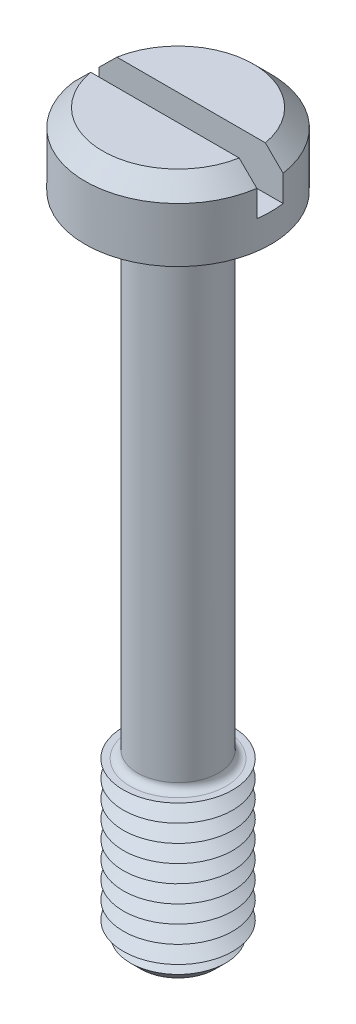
ISO-10303-21;
HEADER;
FILE_DESCRIPTION(('STEP AP214'),'2;1');
FILE_NAME('part.step','',(''),(''),'','','');
FILE_SCHEMA(('AUTOMOTIVE_DESIGN { 1 0 10303 214 1 1 1 1 }'));
ENDSEC;
DATA;
#1=APPLICATION_CONTEXT('core data for automotive mechanical design processes');
#2=APPLICATION_PROTOCOL_DEFINITION('international standard','automotive_design',2000,#1);
#3=PRODUCT_CONTEXT('',#1,'mechanical');
#4=PRODUCT('Part','Part','',(#3));
#5=PRODUCT_RELATED_PRODUCT_CATEGORY('part','',(#4));
#6=PRODUCT_DEFINITION_FORMATION('','',#4);
#7=PRODUCT_DEFINITION_CONTEXT('part definition',#1,'design');
#8=PRODUCT_DEFINITION('design','',#6,#7);
#9=PRODUCT_DEFINITION_SHAPE('','',#8);
#10=(LENGTH_UNIT() NAMED_UNIT(*) SI_UNIT(.MILLI.,.METRE.));
#11=(NAMED_UNIT(*) PLANE_ANGLE_UNIT() SI_UNIT($,.RADIAN.));
#12=(NAMED_UNIT(*) SI_UNIT($,.STERADIAN.) SOLID_ANGLE_UNIT());
#13=UNCERTAINTY_MEASURE_WITH_UNIT(LENGTH_MEASURE(1.E-05),#10,'distance_accuracy_value','');
#14=(GEOMETRIC_REPRESENTATION_CONTEXT(3) GLOBAL_UNCERTAINTY_ASSIGNED_CONTEXT((#13)) GLOBAL_UNIT_ASSIGNED_CONTEXT((#10,
#11,#12)) REPRESENTATION_CONTEXT('',''));
#15=CARTESIAN_POINT('',(0.,0.,0.));
#16=DIRECTION('',(0.,0.,1.));
#17=DIRECTION('',(1.,0.,0.));
#18=AXIS2_PLACEMENT_3D('',#15,#16,#17);
#19=CARTESIAN_POINT('',(0.,3.3,0.));
#20=DIRECTION('',(0.,1.,0.));
#21=DIRECTION('',(0.,0.,1.));
#22=AXIS2_PLACEMENT_3D('',#19,#20,#21);
#23=PLANE('',#22);
#24=DIRECTION('',(-1.,0.,0.));
#25=VECTOR('',#24,1.);
#26=CARTESIAN_POINT('',(4.25,3.3,-0.6));
#27=LINE('',#26,#25);
#28=CARTESIAN_POINT('',(3.39742549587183,3.3,-0.6));
#29=VERTEX_POINT('',#28);
#30=CARTESIAN_POINT('',(-3.39742549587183,3.3,-0.6));
#31=VERTEX_POINT('',#30);
#32=EDGE_CURVE('E110',#29,#31,#27,.T.);
#33=ORIENTED_EDGE('',*,*,#32,.F.);
#34=CARTESIAN_POINT('',(0.,3.3,0.));
#35=DIRECTION('',(0.,1.,0.));
#36=DIRECTION('',(0.,0.,1.));
#37=AXIS2_PLACEMENT_3D('',#34,#35,#36);
#38=CIRCLE('',#37,3.44999999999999);
#39=EDGE_CURVE('E113',#29,#31,#38,.T.);
#40=ORIENTED_EDGE('',*,*,#39,.T.);
#41=EDGE_LOOP('',(#33,#40));
#42=FACE_BOUND('',#41,.T.);
#43=ADVANCED_FACE('F39',(#42),#23,.T.);
#44=CARTESIAN_POINT('',(0.,3.3,0.));
#45=DIRECTION('',(0.,-1.,0.));
#46=DIRECTION('',(0.,0.,-1.));
#47=AXIS2_PLACEMENT_3D('',#44,#45,#46);
#48=CONICAL_SURFACE('',#47,3.44999999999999,0.785398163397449);
#49=CARTESIAN_POINT('',(9.35351408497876,-2.62273843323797,-0.6));
#50=CARTESIAN_POINT('',(9.03263557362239,-2.30252317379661,-0.6));
#51=CARTESIAN_POINT('',(8.7117281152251,-1.98233690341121,-0.6));
#52=CARTESIAN_POINT('',(8.069812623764,-1.34205341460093,-0.6));
#53=CARTESIAN_POINT('',(7.7488045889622,-1.02195619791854,-0.6));
#54=CARTESIAN_POINT('',(7.10652460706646,-0.381761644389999,-0.6));
#55=CARTESIAN_POINT('',(6.78525260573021,-0.0616643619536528,-0.6));
#56=CARTESIAN_POINT('',(6.14251393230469,0.578323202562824,-0.6));
#57=CARTESIAN_POINT('',(5.82104726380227,0.898213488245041,-0.6));
#58=CARTESIAN_POINT('',(5.1719620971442,1.54347500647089,-0.6));
#59=CARTESIAN_POINT('',(4.84433778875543,1.86884039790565,-0.6));
#60=CARTESIAN_POINT('',(4.35244442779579,2.35644593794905,-0.6));
#61=CARTESIAN_POINT('',(4.18839924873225,2.51891187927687,-0.6));
#62=CARTESIAN_POINT('',(3.86009606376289,2.84362679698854,-0.6));
#63=CARTESIAN_POINT('',(3.69583805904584,3.00587577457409,-0.6));
#64=CARTESIAN_POINT('',(3.36705354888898,3.33001661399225,-0.6));
#65=CARTESIAN_POINT('',(3.20252712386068,3.49190855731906,-0.6));
#66=CARTESIAN_POINT('',(2.87298689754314,3.81520272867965,-0.6));
#67=CARTESIAN_POINT('',(2.70797308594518,3.97660494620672,-0.6));
#68=CARTESIAN_POINT('',(2.37716903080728,4.29858210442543,-0.6));
#69=CARTESIAN_POINT('',(2.21137886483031,4.45915712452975,-0.6));
#70=CARTESIAN_POINT('',(1.96157219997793,4.6988460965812,-0.6));
#71=CARTESIAN_POINT('',(1.87811785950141,4.77854546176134,-0.6));
#72=CARTESIAN_POINT('',(1.71066064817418,4.93736532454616,-0.6));
#73=CARTESIAN_POINT('',(1.62665778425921,5.01648582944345,-0.6));
#74=CARTESIAN_POINT('',(1.49655488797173,5.13773269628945,-0.6));
#75=CARTESIAN_POINT('',(1.45074972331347,5.18017521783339,-0.6));
#76=CARTESIAN_POINT('',(1.35882119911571,5.26471614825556,-0.6));
#77=CARTESIAN_POINT('',(1.31269783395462,5.30681455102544,-0.6));
#78=CARTESIAN_POINT('',(1.22008852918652,5.39050695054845,-0.6));
#79=CARTESIAN_POINT('',(1.17360305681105,5.4321014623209,-0.6));
#80=CARTESIAN_POINT('',(1.08007401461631,5.51465347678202,-0.6));
#81=CARTESIAN_POINT('',(1.03303046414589,5.55561100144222,-0.6));
#82=CARTESIAN_POINT('',(0.919047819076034,5.65299331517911,-0.6));
#83=CARTESIAN_POINT('',(0.851738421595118,5.70899242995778,-0.6));
#84=CARTESIAN_POINT('',(0.748806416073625,5.79068526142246,-0.6));
#85=CARTESIAN_POINT('',(0.714125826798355,5.81756213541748,-0.6));
#86=CARTESIAN_POINT('',(0.643915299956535,5.87018079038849,-0.6));
#87=CARTESIAN_POINT('',(0.608385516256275,5.89592277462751,-0.6));
#88=CARTESIAN_POINT('',(0.545162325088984,5.93955652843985,-0.6));
#89=CARTESIAN_POINT('',(0.517718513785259,5.95780799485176,-0.6));
#90=CARTESIAN_POINT('',(0.462025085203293,5.99303174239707,-0.6));
#91=CARTESIAN_POINT('',(0.43377569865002,6.01000438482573,-0.6));
#92=CARTESIAN_POINT('',(0.376341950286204,6.04213837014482,-0.6));
#93=CARTESIAN_POINT('',(0.347160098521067,6.05730412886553,-0.6));
#94=CARTESIAN_POINT('',(0.287642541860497,6.0851339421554,-0.6));
#95=CARTESIAN_POINT('',(0.257308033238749,6.09780051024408,-0.6));
#96=CARTESIAN_POINT('',(0.190863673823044,6.12124627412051,-0.6));
#97=CARTESIAN_POINT('',(0.154554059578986,6.13148571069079,-0.6));
#98=CARTESIAN_POINT('',(0.0807909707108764,6.14565404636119,-0.6));
#99=CARTESIAN_POINT('',(0.043342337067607,6.14960664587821,-0.6));
#100=CARTESIAN_POINT('',(-0.0317987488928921,6.15033783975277,-0.6));
#101=CARTESIAN_POINT('',(-0.0694915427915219,6.14708428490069,-0.6));
#102=CARTESIAN_POINT('',(-0.143790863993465,6.1341092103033,-0.6));
#103=CARTESIAN_POINT('',(-0.18039362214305,6.1243674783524,-0.6));
#104=CARTESIAN_POINT('',(-0.254098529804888,6.09939647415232,-0.6));
#105=CARTESIAN_POINT('',(-0.291094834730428,6.08386859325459,-0.6));
#106=CARTESIAN_POINT('',(-0.363408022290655,6.04924663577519,-0.6));
#107=CARTESIAN_POINT('',(-0.398721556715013,6.03014579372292,-0.6));
#108=CARTESIAN_POINT('',(-0.468234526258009,5.98944452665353,-0.6));
#109=CARTESIAN_POINT('',(-0.502422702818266,5.96782521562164,-0.6));
#110=CARTESIAN_POINT('',(-0.569689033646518,5.92300618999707,-0.6));
#111=CARTESIAN_POINT('',(-0.602768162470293,5.8998079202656,-0.6));
#112=CARTESIAN_POINT('',(-0.671148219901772,5.85008963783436,-0.6));
#113=CARTESIAN_POINT('',(-0.706369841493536,5.82346130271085,-0.6));
#114=CARTESIAN_POINT('',(-0.77608772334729,5.76926828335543,-0.6));
#115=CARTESIAN_POINT('',(-0.810583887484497,5.74170347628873,-0.6));
#116=CARTESIAN_POINT('',(-0.913286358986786,5.65798278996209,-0.6));
#117=CARTESIAN_POINT('',(-0.98067372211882,5.60082541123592,-0.6));
#118=CARTESIAN_POINT('',(-1.11424616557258,5.48490670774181,-0.6));
#119=CARTESIAN_POINT('',(-1.18042891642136,5.4261427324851,-0.6));
#120=CARTESIAN_POINT('',(-1.31191262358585,5.30767463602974,-0.6));
#121=CARTESIAN_POINT('',(-1.37721382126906,5.24797078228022,-0.6));
#122=CARTESIAN_POINT('',(-1.5070108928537,5.12812906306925,-0.6));
#123=CARTESIAN_POINT('',(-1.57150872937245,5.06799331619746,-0.6));
#124=CARTESIAN_POINT('',(-1.7000913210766,4.94727328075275,-0.6));
#125=CARTESIAN_POINT('',(-1.76417604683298,4.88668896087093,-0.6));
#126=CARTESIAN_POINT('',(-1.95584105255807,4.70458824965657,-0.6));
#127=CARTESIAN_POINT('',(-2.08296922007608,4.58259645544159,-0.6));
#128=CARTESIAN_POINT('',(-2.33599178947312,4.3384062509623,-0.6));
#129=CARTESIAN_POINT('',(-2.46188913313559,4.21621087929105,-0.6));
#130=CARTESIAN_POINT('',(-2.71323511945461,3.97135925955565,-0.6));
#131=CARTESIAN_POINT('',(-2.8386837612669,3.84870301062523,-0.6));
#132=CARTESIAN_POINT('',(-3.21459106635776,3.48027743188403,-0.6));
#133=CARTESIAN_POINT('',(-3.46460626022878,3.23405597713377,-0.6));
#134=CARTESIAN_POINT('',(-3.96413793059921,2.74090313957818,-0.6));
#135=CARTESIAN_POINT('',(-4.21365415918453,2.49397150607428,-0.6));
#136=CARTESIAN_POINT('',(-4.71232475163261,1.99974737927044,-0.6));
#137=CARTESIAN_POINT('',(-4.96147911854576,1.75245488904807,-0.6));
#138=CARTESIAN_POINT('',(-5.45958725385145,1.25761544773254,-0.6));
#139=CARTESIAN_POINT('',(-5.70854099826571,1.01006847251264,-0.6));
#140=CARTESIAN_POINT('',(-6.20629498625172,0.514819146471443,-0.6));
#141=CARTESIAN_POINT('',(-6.45509522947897,0.267116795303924,-0.6));
#142=CARTESIAN_POINT('',(-7.20128563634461,-0.476100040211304,-0.6));
#143=CARTESIAN_POINT('',(-7.69851620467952,-0.971774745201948,-0.6));
#144=CARTESIAN_POINT('',(-8.38865115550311,-1.66007026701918,-0.6));
#145=CARTESIAN_POINT('',(-8.58165346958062,-1.85259293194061,-0.6));
#146=CARTESIAN_POINT('',(-8.87112736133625,-2.14139225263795,-0.6));
#147=CARTESIAN_POINT('',(-8.96761014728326,-2.23765767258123,-0.6));
#148=CARTESIAN_POINT('',(-9.16056764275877,-2.43019387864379,-0.6));
#149=CARTESIAN_POINT('',(-9.25704235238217,-2.52646466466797,-0.6));
#150=CARTESIAN_POINT('',(-9.35351408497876,-2.62273843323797,-0.6));
#151=B_SPLINE_CURVE_WITH_KNOTS('',3,(#49,#50,#51,#52,#53,#54,#55,#56,#57,#58,#59,#60,#61,#62,
#63,#64,#65,#66,#67,#68,#69,#70,#71,#72,#73,#74,#75,#76,#77,#78,#79,#80,#81,#82,#83,#84,#85,#86,
#87,#88,#89,#90,#91,#92,#93,#94,#95,#96,#97,#98,#99,#100,#101,#102,#103,#104,#105,#106,#107,
#108,#109,#110,#111,#112,#113,#114,#115,#116,#117,#118,#119,#120,#121,#122,#123,#124,#125,#126,
#127,#128,#129,#130,#131,#132,#133,#134,#135,#136,#137,#138,#139,#140,#141,#142,#143,#144,#145,
#146,#147,#148,#149,#150),.UNSPECIFIED.,.F.,.F.,(4,2,2,2,2,2,2,2,2,2,2,2,2,2,2,2,2,2,2,2,2,2,2,
2,2,2,2,2,2,2,2,2,2,2,2,2,2,2,2,2,2,2,2,2,2,2,2,2,2,2,4),(0.,1.35996600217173,2.71995696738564,
4.08050889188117,5.44103646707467,6.82624457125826,7.51888721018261,8.21152599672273,
8.90398568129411,9.59646011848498,10.288866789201,10.6350581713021,10.9812451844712,
11.1685812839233,11.3559207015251,11.5430489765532,11.7301707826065,11.9927784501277,
12.1243921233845,12.2559821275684,12.3548333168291,12.4536564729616,12.5522329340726,
12.6507097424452,12.763461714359,12.8757876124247,12.9886156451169,13.101796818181,
13.2218851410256,13.3422031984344,13.4634899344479,13.584667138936,13.7171086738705,
13.8495676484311,14.1146090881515,14.3801178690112,14.6455524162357,14.910099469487,
15.17466516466,15.7032346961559,16.2295761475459,16.7559185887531,17.8086237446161,
18.8617626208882,19.9148925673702,20.9681337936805,22.0213773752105,24.1276499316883,
24.9454725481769,25.354353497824,25.7632286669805),.UNSPECIFIED.);
#152=CARTESIAN_POINT('',(4.20743389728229,2.49999999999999,-0.6));
#153=VERTEX_POINT('',#152);
#154=EDGE_CURVE('E268',#153,#29,#151,.T.);
#155=ORIENTED_EDGE('',*,*,#154,.F.);
#156=CARTESIAN_POINT('',(0.,2.49999999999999,0.));
#157=DIRECTION('',(0.,1.,0.));
#158=DIRECTION('',(0.,0.,1.));
#159=AXIS2_PLACEMENT_3D('',#156,#157,#158);
#160=CIRCLE('',#159,4.25);
#161=CARTESIAN_POINT('',(-4.20743389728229,2.49999999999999,-0.6));
#162=VERTEX_POINT('',#161);
#163=EDGE_CURVE('E128',#162,#153,#160,.F.);
#164=ORIENTED_EDGE('',*,*,#163,.F.);
#165=EDGE_CURVE('E102',#31,#162,#151,.T.);
#166=ORIENTED_EDGE('',*,*,#165,.F.);
#167=ORIENTED_EDGE('',*,*,#39,.F.);
#168=EDGE_LOOP('',(#155,#164,#166,#167));
#169=FACE_BOUND('',#168,.T.);
#170=ADVANCED_FACE('F230',(#169),#48,.T.);
#171=CARTESIAN_POINT('',(0.,-30.,0.));
#172=DIRECTION('',(0.,1.,0.));
#173=DIRECTION('',(0.,0.,1.));
#174=AXIS2_PLACEMENT_3D('',#171,#172,#173);
#175=CYLINDRICAL_SURFACE('',#174,1.85);
#176=CARTESIAN_POINT('',(0.,-22.15,0.));
#177=DIRECTION('',(0.,-1.,0.));
#178=DIRECTION('',(0.,0.,-1.));
#179=AXIS2_PLACEMENT_3D('',#176,#177,#178);
#180=CIRCLE('',#179,1.85);
#181=CARTESIAN_POINT('',(0.,-22.15,-1.85));
#182=VERTEX_POINT('',#181);
#183=EDGE_CURVE('E123',#182,#182,#180,.F.);
#184=ORIENTED_EDGE('',*,*,#183,.T.);
#185=EDGE_LOOP('',(#184));
#186=FACE_BOUND('',#185,.T.);
#187=CARTESIAN_POINT('',(0.,-0.35,0.));
#188=DIRECTION('',(0.,1.,0.));
#189=DIRECTION('',(0.,0.,1.));
#190=AXIS2_PLACEMENT_3D('',#187,#188,#189);
#191=CIRCLE('',#190,1.85);
#192=CARTESIAN_POINT('',(0.,-0.35,1.85));
#193=VERTEX_POINT('',#192);
#194=EDGE_CURVE('E382',#193,#193,#191,.F.);
#195=ORIENTED_EDGE('',*,*,#194,.T.);
#196=EDGE_LOOP('',(#195));
#197=FACE_BOUND('',#196,.T.);
#198=ADVANCED_FACE('F226',(#186,#197),#175,.T.);
#199=CARTESIAN_POINT('',(0.,3.3,0.));
#200=DIRECTION('',(0.,-1.,0.));
#201=DIRECTION('',(0.,0.,-1.));
#202=AXIS2_PLACEMENT_3D('',#199,#200,#201);
#203=CYLINDRICAL_SURFACE('',#202,4.25);
#204=ORIENTED_EDGE('',*,*,#163,.T.);
#205=DIRECTION('',(0.,-1.,0.));
#206=VECTOR('',#205,1.);
#207=CARTESIAN_POINT('',(4.20743389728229,3.3,-0.6));
#208=LINE('',#207,#206);
#209=CARTESIAN_POINT('',(4.20743389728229,1.3,-0.6));
#210=VERTEX_POINT('',#209);
#211=EDGE_CURVE('E64',#153,#210,#208,.T.);
#212=ORIENTED_EDGE('',*,*,#211,.T.);
#213=CARTESIAN_POINT('',(0.,1.3,0.));
#214=DIRECTION('',(0.,1.,0.));
#215=DIRECTION('',(0.,0.,1.));
#216=AXIS2_PLACEMENT_3D('',#213,#214,#215);
#217=CIRCLE('',#216,4.25);
#218=CARTESIAN_POINT('',(4.20743389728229,1.3,0.6));
#219=VERTEX_POINT('',#218);
#220=EDGE_CURVE('E11',#219,#210,#217,.T.);
#221=ORIENTED_EDGE('',*,*,#220,.F.);
#222=DIRECTION('',(0.,-1.,0.));
#223=VECTOR('',#222,1.);
#224=CARTESIAN_POINT('',(4.20743389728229,3.3,0.6));
#225=LINE('',#224,#223);
#226=CARTESIAN_POINT('',(4.20743389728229,2.49999999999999,0.6));
#227=VERTEX_POINT('',#226);
#228=EDGE_CURVE('E285',#219,#227,#225,.F.);
#229=ORIENTED_EDGE('',*,*,#228,.T.);
#230=CARTESIAN_POINT('',(-4.20743389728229,2.49999999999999,0.6));
#231=VERTEX_POINT('',#230);
#232=EDGE_CURVE('E120',#227,#231,#160,.F.);
#233=ORIENTED_EDGE('',*,*,#232,.T.);
#234=DIRECTION('',(0.,-1.,0.));
#235=VECTOR('',#234,1.);
#236=CARTESIAN_POINT('',(-4.20743389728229,3.3,0.6));
#237=LINE('',#236,#235);
#238=CARTESIAN_POINT('',(-4.20743389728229,1.3,0.6));
#239=VERTEX_POINT('',#238);
#240=EDGE_CURVE('E96',#231,#239,#237,.T.);
#241=ORIENTED_EDGE('',*,*,#240,.T.);
#242=CARTESIAN_POINT('',(-4.20743389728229,1.3,-0.6));
#243=VERTEX_POINT('',#242);
#244=EDGE_CURVE('E44',#243,#239,#217,.T.);
#245=ORIENTED_EDGE('',*,*,#244,.F.);
#246=DIRECTION('',(0.,-1.,0.));
#247=VECTOR('',#246,1.);
#248=CARTESIAN_POINT('',(-4.20743389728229,3.3,-0.6));
#249=LINE('',#248,#247);
#250=EDGE_CURVE('E290',#243,#162,#249,.F.);
#251=ORIENTED_EDGE('',*,*,#250,.T.);
#252=EDGE_LOOP('',(#204,#212,#221,#229,#233,#241,#245,#251));
#253=FACE_BOUND('',#252,.T.);
#254=CARTESIAN_POINT('',(0.,0.,0.));
#255=DIRECTION('',(0.,1.,0.));
#256=DIRECTION('',(0.,0.,1.));
#257=AXIS2_PLACEMENT_3D('',#254,#255,#256);
#258=CIRCLE('',#257,4.25);
#259=CARTESIAN_POINT('',(0.,0.,4.25));
#260=VERTEX_POINT('',#259);
#261=EDGE_CURVE('E367',#260,#260,#258,.T.);
#262=ORIENTED_EDGE('',*,*,#261,.T.);
#263=EDGE_LOOP('',(#262));
#264=FACE_BOUND('',#263,.T.);
#265=ADVANCED_FACE('F229',(#253,#264),#203,.T.);
#266=DIRECTION('',(1.,0.,0.));
#267=VECTOR('',#266,1.);
#268=CARTESIAN_POINT('',(4.25,3.3,0.6));
#269=LINE('',#268,#267);
#270=CARTESIAN_POINT('',(-3.39742549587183,3.3,0.6));
#271=VERTEX_POINT('',#270);
#272=CARTESIAN_POINT('',(3.39742549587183,3.3,0.6));
#273=VERTEX_POINT('',#272);
#274=EDGE_CURVE('E56',#271,#273,#269,.T.);
#275=ORIENTED_EDGE('',*,*,#274,.F.);
#276=EDGE_CURVE('E108',#271,#273,#38,.T.);
#277=ORIENTED_EDGE('',*,*,#276,.T.);
#278=EDGE_LOOP('',(#275,#277));
#279=FACE_BOUND('',#278,.T.);
#280=ADVANCED_FACE('F107',(#279),#23,.T.);
#281=CARTESIAN_POINT('',(0.,0.,0.));
#282=DIRECTION('',(0.,1.,0.));
#283=DIRECTION('',(0.,0.,1.));
#284=AXIS2_PLACEMENT_3D('',#281,#282,#283);
#285=PLANE('',#284);
#286=CARTESIAN_POINT('',(0.,0.,0.));
#287=DIRECTION('',(0.,1.,0.));
#288=DIRECTION('',(0.,0.,1.));
#289=AXIS2_PLACEMENT_3D('',#286,#287,#288);
#290=CIRCLE('',#289,2.2);
#291=CARTESIAN_POINT('',(0.,0.,2.2));
#292=VERTEX_POINT('',#291);
#293=EDGE_CURVE('E114',#292,#292,#290,.T.);
#294=ORIENTED_EDGE('',*,*,#293,.T.);
#295=EDGE_LOOP('',(#294));
#296=FACE_BOUND('',#295,.T.);
#297=ORIENTED_EDGE('',*,*,#261,.F.);
#298=EDGE_LOOP('',(#297));
#299=FACE_BOUND('',#298,.T.);
#300=ADVANCED_FACE('F220',(#296,#299),#285,.F.);
#301=CARTESIAN_POINT('',(0.,-22.5,0.));
#302=DIRECTION('',(0.,-1.,0.));
#303=DIRECTION('',(0.,0.,-1.));
#304=AXIS2_PLACEMENT_3D('',#301,#302,#303);
#305=PLANE('',#304);
#306=CARTESIAN_POINT('',(0.,-22.5,0.));
#307=DIRECTION('',(0.,-1.,0.));
#308=DIRECTION('',(0.,0.,-1.));
#309=AXIS2_PLACEMENT_3D('',#306,#307,#308);
#310=CIRCLE('',#309,2.2);
#311=CARTESIAN_POINT('',(0.,-22.5,-2.2));
#312=VERTEX_POINT('',#311);
#313=EDGE_CURVE('E375',#312,#312,#310,.T.);
#314=ORIENTED_EDGE('',*,*,#313,.T.);
#315=EDGE_LOOP('',(#314));
#316=FACE_BOUND('',#315,.T.);
#317=CARTESIAN_POINT('',(0.,-22.5,0.));
#318=DIRECTION('',(0.,1.,0.));
#319=DIRECTION('',(0.,0.,1.));
#320=AXIS2_PLACEMENT_3D('',#317,#318,#319);
#321=CIRCLE('',#320,2.5);
#322=CARTESIAN_POINT('',(0.,-22.5,2.5));
#323=VERTEX_POINT('',#322);
#324=EDGE_CURVE('E363',#323,#323,#321,.T.);
#325=ORIENTED_EDGE('',*,*,#324,.T.);
#326=EDGE_LOOP('',(#325));
#327=FACE_BOUND('',#326,.T.);
#328=ADVANCED_FACE('F216',(#316,#327),#305,.F.);
#329=CARTESIAN_POINT('',(0.,-22.9,0.));
#330=DIRECTION('',(0.,1.,0.));
#331=DIRECTION('',(0.,0.,1.));
#332=AXIS2_PLACEMENT_3D('',#329,#330,#331);
#333=CONICAL_SURFACE('',#332,1.80717967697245,1.0471975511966);
#334=ORIENTED_EDGE('',*,*,#324,.F.);
#335=EDGE_LOOP('',(#334));
#336=FACE_BOUND('',#335,.T.);
#337=CARTESIAN_POINT('',(0.,-22.9,0.));
#338=DIRECTION('',(0.,1.,0.));
#339=DIRECTION('',(0.,0.,1.));
#340=AXIS2_PLACEMENT_3D('',#337,#338,#339);
#341=CIRCLE('',#340,1.80717967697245);
#342=CARTESIAN_POINT('',(0.,-22.9,1.80717967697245));
#343=VERTEX_POINT('',#342);
#344=EDGE_CURVE('E359',#343,#343,#341,.T.);
#345=ORIENTED_EDGE('',*,*,#344,.T.);
#346=EDGE_LOOP('',(#345));
#347=FACE_BOUND('',#346,.T.);
#348=ADVANCED_FACE('F212',(#336,#347),#333,.T.);
#349=CARTESIAN_POINT('',(0.,-23.3,0.));
#350=DIRECTION('',(0.,-1.,0.));
#351=DIRECTION('',(0.,0.,-1.));
#352=AXIS2_PLACEMENT_3D('',#349,#350,#351);
#353=CONICAL_SURFACE('',#352,2.5,1.0471975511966);
#354=ORIENTED_EDGE('',*,*,#344,.F.);
#355=EDGE_LOOP('',(#354));
#356=FACE_BOUND('',#355,.T.);
#357=CARTESIAN_POINT('',(0.,-23.3,0.));
#358=DIRECTION('',(0.,1.,0.));
#359=DIRECTION('',(0.,0.,1.));
#360=AXIS2_PLACEMENT_3D('',#357,#358,#359);
#361=CIRCLE('',#360,2.5);
#362=CARTESIAN_POINT('',(0.,-23.3,2.5));
#363=VERTEX_POINT('',#362);
#364=EDGE_CURVE('E355',#363,#363,#361,.T.);
#365=ORIENTED_EDGE('',*,*,#364,.T.);
#366=EDGE_LOOP('',(#365));
#367=FACE_BOUND('',#366,.T.);
#368=ADVANCED_FACE('F208',(#356,#367),#353,.T.);
#369=CARTESIAN_POINT('',(0.,-23.7,0.));
#370=DIRECTION('',(0.,1.,0.));
#371=DIRECTION('',(0.,0.,1.));
#372=AXIS2_PLACEMENT_3D('',#369,#370,#371);
#373=CONICAL_SURFACE('',#372,1.80717967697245,1.0471975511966);
#374=ORIENTED_EDGE('',*,*,#364,.F.);
#375=EDGE_LOOP('',(#374));
#376=FACE_BOUND('',#375,.T.);
#377=CARTESIAN_POINT('',(0.,-23.7,0.));
#378=DIRECTION('',(0.,1.,0.));
#379=DIRECTION('',(0.,0.,1.));
#380=AXIS2_PLACEMENT_3D('',#377,#378,#379);
#381=CIRCLE('',#380,1.80717967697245);
#382=CARTESIAN_POINT('',(0.,-23.7,1.80717967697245));
#383=VERTEX_POINT('',#382);
#384=EDGE_CURVE('E351',#383,#383,#381,.T.);
#385=ORIENTED_EDGE('',*,*,#384,.T.);
#386=EDGE_LOOP('',(#385));
#387=FACE_BOUND('',#386,.T.);
#388=ADVANCED_FACE('F204',(#376,#387),#373,.T.);
#389=CARTESIAN_POINT('',(0.,-24.1,0.));
#390=DIRECTION('',(0.,-1.,0.));
#391=DIRECTION('',(0.,0.,-1.));
#392=AXIS2_PLACEMENT_3D('',#389,#390,#391);
#393=CONICAL_SURFACE('',#392,2.5,1.0471975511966);
#394=ORIENTED_EDGE('',*,*,#384,.F.);
#395=EDGE_LOOP('',(#394));
#396=FACE_BOUND('',#395,.T.);
#397=CARTESIAN_POINT('',(0.,-24.1,0.));
#398=DIRECTION('',(0.,1.,0.));
#399=DIRECTION('',(0.,0.,1.));
#400=AXIS2_PLACEMENT_3D('',#397,#398,#399);
#401=CIRCLE('',#400,2.5);
#402=CARTESIAN_POINT('',(0.,-24.1,2.5));
#403=VERTEX_POINT('',#402);
#404=EDGE_CURVE('E348',#403,#403,#401,.T.);
#405=ORIENTED_EDGE('',*,*,#404,.T.);
#406=EDGE_LOOP('',(#405));
#407=FACE_BOUND('',#406,.T.);
#408=ADVANCED_FACE('F200',(#396,#407),#393,.T.);
#409=CARTESIAN_POINT('',(0.,-24.5,0.));
#410=DIRECTION('',(0.,1.,0.));
#411=DIRECTION('',(0.,0.,1.));
#412=AXIS2_PLACEMENT_3D('',#409,#410,#411);
#413=CONICAL_SURFACE('',#412,1.80717967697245,1.0471975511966);
#414=ORIENTED_EDGE('',*,*,#404,.F.);
#415=EDGE_LOOP('',(#414));
#416=FACE_BOUND('',#415,.T.);
#417=CARTESIAN_POINT('',(0.,-24.5,0.));
#418=DIRECTION('',(0.,1.,0.));
#419=DIRECTION('',(0.,0.,1.));
#420=AXIS2_PLACEMENT_3D('',#417,#418,#419);
#421=CIRCLE('',#420,1.80717967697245);
#422=CARTESIAN_POINT('',(0.,-24.5,1.80717967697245));
#423=VERTEX_POINT('',#422);
#424=EDGE_CURVE('E344',#423,#423,#421,.T.);
#425=ORIENTED_EDGE('',*,*,#424,.T.);
#426=EDGE_LOOP('',(#425));
#427=FACE_BOUND('',#426,.T.);
#428=ADVANCED_FACE('F196',(#416,#427),#413,.T.);
#429=CARTESIAN_POINT('',(0.,-24.9,0.));
#430=DIRECTION('',(0.,-1.,0.));
#431=DIRECTION('',(0.,0.,-1.));
#432=AXIS2_PLACEMENT_3D('',#429,#430,#431);
#433=CONICAL_SURFACE('',#432,2.5,1.0471975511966);
#434=ORIENTED_EDGE('',*,*,#424,.F.);
#435=EDGE_LOOP('',(#434));
#436=FACE_BOUND('',#435,.T.);
#437=CARTESIAN_POINT('',(0.,-24.9,0.));
#438=DIRECTION('',(0.,1.,0.));
#439=DIRECTION('',(0.,0.,1.));
#440=AXIS2_PLACEMENT_3D('',#437,#438,#439);
#441=CIRCLE('',#440,2.5);
#442=CARTESIAN_POINT('',(0.,-24.9,2.5));
#443=VERTEX_POINT('',#442);
#444=EDGE_CURVE('E340',#443,#443,#441,.T.);
#445=ORIENTED_EDGE('',*,*,#444,.T.);
#446=EDGE_LOOP('',(#445));
#447=FACE_BOUND('',#446,.T.);
#448=ADVANCED_FACE('F192',(#436,#447),#433,.T.);
#449=CARTESIAN_POINT('',(0.,-25.3,0.));
#450=DIRECTION('',(0.,1.,0.));
#451=DIRECTION('',(0.,0.,1.));
#452=AXIS2_PLACEMENT_3D('',#449,#450,#451);
#453=CONICAL_SURFACE('',#452,1.80717967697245,1.0471975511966);
#454=ORIENTED_EDGE('',*,*,#444,.F.);
#455=EDGE_LOOP('',(#454));
#456=FACE_BOUND('',#455,.T.);
#457=CARTESIAN_POINT('',(0.,-25.3,0.));
#458=DIRECTION('',(0.,1.,0.));
#459=DIRECTION('',(0.,0.,1.));
#460=AXIS2_PLACEMENT_3D('',#457,#458,#459);
#461=CIRCLE('',#460,1.80717967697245);
#462=CARTESIAN_POINT('',(0.,-25.3,1.80717967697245));
#463=VERTEX_POINT('',#462);
#464=EDGE_CURVE('E336',#463,#463,#461,.T.);
#465=ORIENTED_EDGE('',*,*,#464,.T.);
#466=EDGE_LOOP('',(#465));
#467=FACE_BOUND('',#466,.T.);
#468=ADVANCED_FACE('F188',(#456,#467),#453,.T.);
#469=CARTESIAN_POINT('',(0.,-25.7,0.));
#470=DIRECTION('',(0.,-1.,0.));
#471=DIRECTION('',(0.,0.,-1.));
#472=AXIS2_PLACEMENT_3D('',#469,#470,#471);
#473=CONICAL_SURFACE('',#472,2.5,1.0471975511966);
#474=ORIENTED_EDGE('',*,*,#464,.F.);
#475=EDGE_LOOP('',(#474));
#476=FACE_BOUND('',#475,.T.);
#477=CARTESIAN_POINT('',(0.,-25.7,0.));
#478=DIRECTION('',(0.,1.,0.));
#479=DIRECTION('',(0.,0.,1.));
#480=AXIS2_PLACEMENT_3D('',#477,#478,#479);
#481=CIRCLE('',#480,2.5);
#482=CARTESIAN_POINT('',(0.,-25.7,2.5));
#483=VERTEX_POINT('',#482);
#484=EDGE_CURVE('E333',#483,#483,#481,.T.);
#485=ORIENTED_EDGE('',*,*,#484,.T.);
#486=EDGE_LOOP('',(#485));
#487=FACE_BOUND('',#486,.T.);
#488=ADVANCED_FACE('F184',(#476,#487),#473,.T.);
#489=CARTESIAN_POINT('',(0.,-26.1,0.));
#490=DIRECTION('',(0.,1.,0.));
#491=DIRECTION('',(0.,0.,1.));
#492=AXIS2_PLACEMENT_3D('',#489,#490,#491);
#493=CONICAL_SURFACE('',#492,1.80717967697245,1.0471975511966);
#494=ORIENTED_EDGE('',*,*,#484,.F.);
#495=EDGE_LOOP('',(#494));
#496=FACE_BOUND('',#495,.T.);
#497=CARTESIAN_POINT('',(0.,-26.1,0.));
#498=DIRECTION('',(0.,1.,0.));
#499=DIRECTION('',(0.,0.,1.));
#500=AXIS2_PLACEMENT_3D('',#497,#498,#499);
#501=CIRCLE('',#500,1.80717967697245);
#502=CARTESIAN_POINT('',(0.,-26.1,1.80717967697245));
#503=VERTEX_POINT('',#502);
#504=EDGE_CURVE('E330',#503,#503,#501,.T.);
#505=ORIENTED_EDGE('',*,*,#504,.T.);
#506=EDGE_LOOP('',(#505));
#507=FACE_BOUND('',#506,.T.);
#508=ADVANCED_FACE('F180',(#496,#507),#493,.T.);
#509=CARTESIAN_POINT('',(0.,-26.5,0.));
#510=DIRECTION('',(0.,-1.,0.));
#511=DIRECTION('',(0.,0.,-1.));
#512=AXIS2_PLACEMENT_3D('',#509,#510,#511);
#513=CONICAL_SURFACE('',#512,2.5,1.0471975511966);
#514=ORIENTED_EDGE('',*,*,#504,.F.);
#515=EDGE_LOOP('',(#514));
#516=FACE_BOUND('',#515,.T.);
#517=CARTESIAN_POINT('',(0.,-26.5,0.));
#518=DIRECTION('',(0.,1.,0.));
#519=DIRECTION('',(0.,0.,1.));
#520=AXIS2_PLACEMENT_3D('',#517,#518,#519);
#521=CIRCLE('',#520,2.5);
#522=CARTESIAN_POINT('',(0.,-26.5,2.5));
#523=VERTEX_POINT('',#522);
#524=EDGE_CURVE('E327',#523,#523,#521,.T.);
#525=ORIENTED_EDGE('',*,*,#524,.T.);
#526=EDGE_LOOP('',(#525));
#527=FACE_BOUND('',#526,.T.);
#528=ADVANCED_FACE('F176',(#516,#527),#513,.T.);
#529=CARTESIAN_POINT('',(0.,-26.9,0.));
#530=DIRECTION('',(0.,1.,0.));
#531=DIRECTION('',(0.,0.,1.));
#532=AXIS2_PLACEMENT_3D('',#529,#530,#531);
#533=CONICAL_SURFACE('',#532,1.80717967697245,1.0471975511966);
#534=ORIENTED_EDGE('',*,*,#524,.F.);
#535=EDGE_LOOP('',(#534));
#536=FACE_BOUND('',#535,.T.);
#537=CARTESIAN_POINT('',(0.,-26.9,0.));
#538=DIRECTION('',(0.,1.,0.));
#539=DIRECTION('',(0.,0.,1.));
#540=AXIS2_PLACEMENT_3D('',#537,#538,#539);
#541=CIRCLE('',#540,1.80717967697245);
#542=CARTESIAN_POINT('',(0.,-26.9,1.80717967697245));
#543=VERTEX_POINT('',#542);
#544=EDGE_CURVE('E323',#543,#543,#541,.T.);
#545=ORIENTED_EDGE('',*,*,#544,.T.);
#546=EDGE_LOOP('',(#545));
#547=FACE_BOUND('',#546,.T.);
#548=ADVANCED_FACE('F172',(#536,#547),#533,.T.);
#549=CARTESIAN_POINT('',(0.,-27.3,0.));
#550=DIRECTION('',(0.,-1.,0.));
#551=DIRECTION('',(0.,0.,-1.));
#552=AXIS2_PLACEMENT_3D('',#549,#550,#551);
#553=CONICAL_SURFACE('',#552,2.5,1.0471975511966);
#554=ORIENTED_EDGE('',*,*,#544,.F.);
#555=EDGE_LOOP('',(#554));
#556=FACE_BOUND('',#555,.T.);
#557=CARTESIAN_POINT('',(0.,-27.3,0.));
#558=DIRECTION('',(0.,1.,0.));
#559=DIRECTION('',(0.,0.,1.));
#560=AXIS2_PLACEMENT_3D('',#557,#558,#559);
#561=CIRCLE('',#560,2.5);
#562=CARTESIAN_POINT('',(0.,-27.3,2.5));
#563=VERTEX_POINT('',#562);
#564=EDGE_CURVE('E319',#563,#563,#561,.T.);
#565=ORIENTED_EDGE('',*,*,#564,.T.);
#566=EDGE_LOOP('',(#565));
#567=FACE_BOUND('',#566,.T.);
#568=ADVANCED_FACE('F168',(#556,#567),#553,.T.);
#569=CARTESIAN_POINT('',(0.,-27.7,0.));
#570=DIRECTION('',(0.,1.,0.));
#571=DIRECTION('',(0.,0.,1.));
#572=AXIS2_PLACEMENT_3D('',#569,#570,#571);
#573=CONICAL_SURFACE('',#572,1.80717967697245,1.0471975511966);
#574=ORIENTED_EDGE('',*,*,#564,.F.);
#575=EDGE_LOOP('',(#574));
#576=FACE_BOUND('',#575,.T.);
#577=CARTESIAN_POINT('',(0.,-27.7,0.));
#578=DIRECTION('',(0.,1.,0.));
#579=DIRECTION('',(0.,0.,1.));
#580=AXIS2_PLACEMENT_3D('',#577,#578,#579);
#581=CIRCLE('',#580,1.80717967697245);
#582=CARTESIAN_POINT('',(0.,-27.7,1.80717967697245));
#583=VERTEX_POINT('',#582);
#584=EDGE_CURVE('E315',#583,#583,#581,.T.);
#585=ORIENTED_EDGE('',*,*,#584,.T.);
#586=EDGE_LOOP('',(#585));
#587=FACE_BOUND('',#586,.T.);
#588=ADVANCED_FACE('F164',(#576,#587),#573,.T.);
#589=CARTESIAN_POINT('',(0.,-28.1,0.));
#590=DIRECTION('',(0.,-1.,0.));
#591=DIRECTION('',(0.,0.,-1.));
#592=AXIS2_PLACEMENT_3D('',#589,#590,#591);
#593=CONICAL_SURFACE('',#592,2.5,1.0471975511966);
#594=ORIENTED_EDGE('',*,*,#584,.F.);
#595=EDGE_LOOP('',(#594));
#596=FACE_BOUND('',#595,.T.);
#597=CARTESIAN_POINT('',(0.,-28.1,0.));
#598=DIRECTION('',(0.,1.,0.));
#599=DIRECTION('',(0.,0.,1.));
#600=AXIS2_PLACEMENT_3D('',#597,#598,#599);
#601=CIRCLE('',#600,2.5);
#602=CARTESIAN_POINT('',(0.,-28.1,2.5));
#603=VERTEX_POINT('',#602);
#604=EDGE_CURVE('E311',#603,#603,#601,.T.);
#605=ORIENTED_EDGE('',*,*,#604,.T.);
#606=EDGE_LOOP('',(#605));
#607=FACE_BOUND('',#606,.T.);
#608=ADVANCED_FACE('F160',(#596,#607),#593,.T.);
#609=CARTESIAN_POINT('',(0.,-28.5,0.));
#610=DIRECTION('',(0.,1.,0.));
#611=DIRECTION('',(0.,0.,1.));
#612=AXIS2_PLACEMENT_3D('',#609,#610,#611);
#613=CONICAL_SURFACE('',#612,1.80717967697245,1.0471975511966);
#614=ORIENTED_EDGE('',*,*,#604,.F.);
#615=EDGE_LOOP('',(#614));
#616=FACE_BOUND('',#615,.T.);
#617=CARTESIAN_POINT('',(0.,-28.5,0.));
#618=DIRECTION('',(0.,1.,0.));
#619=DIRECTION('',(0.,0.,1.));
#620=AXIS2_PLACEMENT_3D('',#617,#618,#619);
#621=CIRCLE('',#620,1.80717967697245);
#622=CARTESIAN_POINT('',(0.,-28.5,1.80717967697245));
#623=VERTEX_POINT('',#622);
#624=EDGE_CURVE('E307',#623,#623,#621,.T.);
#625=ORIENTED_EDGE('',*,*,#624,.T.);
#626=EDGE_LOOP('',(#625));
#627=FACE_BOUND('',#626,.T.);
#628=ADVANCED_FACE('F156',(#616,#627),#613,.T.);
#629=CARTESIAN_POINT('',(0.,-28.9,0.));
#630=DIRECTION('',(0.,-1.,0.));
#631=DIRECTION('',(0.,0.,-1.));
#632=AXIS2_PLACEMENT_3D('',#629,#630,#631);
#633=CONICAL_SURFACE('',#632,2.5,1.0471975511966);
#634=ORIENTED_EDGE('',*,*,#624,.F.);
#635=EDGE_LOOP('',(#634));
#636=FACE_BOUND('',#635,.T.);
#637=CARTESIAN_POINT('',(0.,-28.9,0.));
#638=DIRECTION('',(0.,1.,0.));
#639=DIRECTION('',(0.,0.,1.));
#640=AXIS2_PLACEMENT_3D('',#637,#638,#639);
#641=CIRCLE('',#640,2.5);
#642=CARTESIAN_POINT('',(0.,-28.9,2.5));
#643=VERTEX_POINT('',#642);
#644=EDGE_CURVE('E303',#643,#643,#641,.T.);
#645=ORIENTED_EDGE('',*,*,#644,.T.);
#646=EDGE_LOOP('',(#645));
#647=FACE_BOUND('',#646,.T.);
#648=ADVANCED_FACE('F152',(#636,#647),#633,.T.);
#649=CARTESIAN_POINT('',(0.,-29.3,0.));
#650=DIRECTION('',(0.,1.,0.));
#651=DIRECTION('',(0.,0.,1.));
#652=AXIS2_PLACEMENT_3D('',#649,#650,#651);
#653=CONICAL_SURFACE('',#652,1.80717967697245,1.0471975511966);
#654=ORIENTED_EDGE('',*,*,#644,.F.);
#655=EDGE_LOOP('',(#654));
#656=FACE_BOUND('',#655,.T.);
#657=CARTESIAN_POINT('',(0.,-29.3,0.));
#658=DIRECTION('',(0.,1.,0.));
#659=DIRECTION('',(0.,0.,1.));
#660=AXIS2_PLACEMENT_3D('',#657,#658,#659);
#661=CIRCLE('',#660,1.80717967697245);
#662=CARTESIAN_POINT('',(0.,-29.3,1.80717967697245));
#663=VERTEX_POINT('',#662);
#664=EDGE_CURVE('E299',#663,#663,#661,.T.);
#665=ORIENTED_EDGE('',*,*,#664,.T.);
#666=EDGE_LOOP('',(#665));
#667=FACE_BOUND('',#666,.T.);
#668=ADVANCED_FACE('F148',(#656,#667),#653,.T.);
#669=CARTESIAN_POINT('',(0.,-29.7,0.));
#670=DIRECTION('',(0.,-1.,0.));
#671=DIRECTION('',(0.,0.,-1.));
#672=AXIS2_PLACEMENT_3D('',#669,#670,#671);
#673=CONICAL_SURFACE('',#672,2.5,1.0471975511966);
#674=CARTESIAN_POINT('',(0.,-29.5169872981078,0.));
#675=DIRECTION('',(0.,-1.,0.));
#676=DIRECTION('',(0.,0.,-1.));
#677=AXIS2_PLACEMENT_3D('',#674,#675,#676);
#678=CIRCLE('',#677,2.18301270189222);
#679=CARTESIAN_POINT('',(0.,-29.5169872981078,2.18301270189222));
#680=VERTEX_POINT('',#679);
#681=EDGE_CURVE('E306',#680,#680,#678,.F.);
#682=ORIENTED_EDGE('',*,*,#681,.T.);
#683=EDGE_LOOP('',(#682));
#684=FACE_BOUND('',#683,.T.);
#685=ORIENTED_EDGE('',*,*,#664,.F.);
#686=EDGE_LOOP('',(#685));
#687=FACE_BOUND('',#686,.T.);
#688=ADVANCED_FACE('F144',(#684,#687),#673,.T.);
#689=CARTESIAN_POINT('',(0.,-30.,0.));
#690=DIRECTION('',(0.,-1.,0.));
#691=DIRECTION('',(0.,0.,-1.));
#692=AXIS2_PLACEMENT_3D('',#689,#690,#691);
#693=PLANE('',#692);
#694=CARTESIAN_POINT('',(0.,-30.,0.));
#695=DIRECTION('',(0.,-1.,0.));
#696=DIRECTION('',(0.,0.,-1.));
#697=AXIS2_PLACEMENT_3D('',#694,#695,#696);
#698=CIRCLE('',#697,1.70000000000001);
#699=CARTESIAN_POINT('',(0.,-30.,1.70000000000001));
#700=VERTEX_POINT('',#699);
#701=EDGE_CURVE('E371',#700,#700,#698,.T.);
#702=ORIENTED_EDGE('',*,*,#701,.T.);
#703=EDGE_LOOP('',(#702));
#704=FACE_BOUND('',#703,.T.);
#705=ADVANCED_FACE('F147',(#704),#693,.T.);
#706=CARTESIAN_POINT('',(0.,-30.,0.));
#707=DIRECTION('',(0.,1.,0.));
#708=DIRECTION('',(0.,0.,1.));
#709=AXIS2_PLACEMENT_3D('',#706,#707,#708);
#710=CONICAL_SURFACE('',#709,1.70000000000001,0.785398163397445);
#711=CARTESIAN_POINT('',(0.,-29.5169872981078,2.18301270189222));
#712=CARTESIAN_POINT('',(0.,-29.5220186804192,2.17798131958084));
#713=CARTESIAN_POINT('',(0.,-29.5270500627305,2.17294993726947));
#714=CARTESIAN_POINT('',(0.,-29.5371128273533,2.16288717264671));
#715=CARTESIAN_POINT('',(0.,-29.5421442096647,2.15785579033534));
#716=CARTESIAN_POINT('',(0.,-29.5522069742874,2.14779302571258));
#717=CARTESIAN_POINT('',(0.,-29.5572383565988,2.1427616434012));
#718=CARTESIAN_POINT('',(0.,-29.5673011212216,2.13269887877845));
#719=CARTESIAN_POINT('',(0.,-29.5723325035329,2.12766749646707));
#720=CARTESIAN_POINT('',(0.,-29.5823952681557,2.11760473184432));
#721=CARTESIAN_POINT('',(0.,-29.5874266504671,2.11257334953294));
#722=CARTESIAN_POINT('',(0.,-29.5974894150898,2.10251058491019));
#723=CARTESIAN_POINT('',(0.,-29.6025207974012,2.09747920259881));
#724=CARTESIAN_POINT('',(0.,-29.6125835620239,2.08741643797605));
#725=CARTESIAN_POINT('',(0.,-29.6176149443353,2.08238505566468));
#726=CARTESIAN_POINT('',(0.,-29.6276777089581,2.07232229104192));
#727=CARTESIAN_POINT('',(0.,-29.6327090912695,2.06729090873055));
#728=CARTESIAN_POINT('',(0.,-29.6427718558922,2.05722814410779));
#729=CARTESIAN_POINT('',(0.,-29.6478032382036,2.05219676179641));
#730=CARTESIAN_POINT('',(0.,-29.6578660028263,2.04213399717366));
#731=CARTESIAN_POINT('',(0.,-29.6628973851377,2.03710261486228));
#732=CARTESIAN_POINT('',(0.,-29.6729601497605,2.02703985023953));
#733=CARTESIAN_POINT('',(0.,-29.6779915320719,2.02200846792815));
#734=CARTESIAN_POINT('',(0.,-29.6880542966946,2.0119457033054));
#735=CARTESIAN_POINT('',(0.,-29.693085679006,2.00691432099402));
#736=CARTESIAN_POINT('',(0.,-29.7031484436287,1.99685155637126));
#737=CARTESIAN_POINT('',(0.,-29.7081798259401,1.99182017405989));
#738=CARTESIAN_POINT('',(0.,-29.7182425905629,1.98175740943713));
#739=CARTESIAN_POINT('',(0.,-29.7232739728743,1.97672602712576));
#740=CARTESIAN_POINT('',(0.,-29.733336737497,1.966663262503));
#741=CARTESIAN_POINT('',(0.,-29.7383681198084,1.96163188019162));
#742=CARTESIAN_POINT('',(0.,-29.7484308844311,1.95156911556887));
#743=CARTESIAN_POINT('',(0.,-29.7534622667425,1.94653773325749));
#744=CARTESIAN_POINT('',(0.,-29.7635250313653,1.93647496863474));
#745=CARTESIAN_POINT('',(0.,-29.7685564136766,1.93144358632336));
#746=CARTESIAN_POINT('',(0.,-29.7786191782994,1.92138082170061));
#747=CARTESIAN_POINT('',(0.,-29.7836505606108,1.91634943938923));
#748=CARTESIAN_POINT('',(0.,-29.7937133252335,1.90628667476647));
#749=CARTESIAN_POINT('',(0.,-29.7987447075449,1.9012552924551));
#750=CARTESIAN_POINT('',(0.,-29.8088074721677,1.89119252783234));
#751=CARTESIAN_POINT('',(0.,-29.813838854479,1.88616114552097));
#752=CARTESIAN_POINT('',(0.,-29.8239016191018,1.87609838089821));
#753=CARTESIAN_POINT('',(0.,-29.8289330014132,1.87106699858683));
#754=CARTESIAN_POINT('',(0.,-29.8389957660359,1.86100423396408));
#755=CARTESIAN_POINT('',(0.,-29.8440271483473,1.8559728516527));
#756=CARTESIAN_POINT('',(0.,-29.8540899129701,1.84591008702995));
#757=CARTESIAN_POINT('',(0.,-29.8591212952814,1.84087870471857));
#758=CARTESIAN_POINT('',(0.,-29.8691840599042,1.83081594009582));
#759=CARTESIAN_POINT('',(0.,-29.8742154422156,1.82578455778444));
#760=CARTESIAN_POINT('',(0.,-29.8842782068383,1.81572179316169));
#761=CARTESIAN_POINT('',(0.,-29.8893095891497,1.81069041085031));
#762=CARTESIAN_POINT('',(0.,-29.8993723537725,1.80062764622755));
#763=CARTESIAN_POINT('',(0.,-29.9044037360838,1.79559626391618));
#764=CARTESIAN_POINT('',(0.,-29.9144665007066,1.78553349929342));
#765=CARTESIAN_POINT('',(0.,-29.919497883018,1.78050211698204));
#766=CARTESIAN_POINT('',(0.,-29.9295606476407,1.77043935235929));
#767=CARTESIAN_POINT('',(0.,-29.9345920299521,1.76540797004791));
#768=CARTESIAN_POINT('',(0.,-29.9446547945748,1.75534520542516));
#769=CARTESIAN_POINT('',(0.,-29.9496861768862,1.75031382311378));
#770=CARTESIAN_POINT('',(0.,-29.959748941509,1.74025105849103));
#771=CARTESIAN_POINT('',(0.,-29.9647803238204,1.73521967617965));
#772=CARTESIAN_POINT('',(0.,-29.9748430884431,1.72515691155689));
#773=CARTESIAN_POINT('',(0.,-29.9798744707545,1.72012552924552));
#774=CARTESIAN_POINT('',(0.,-29.9899372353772,1.71006276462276));
#775=CARTESIAN_POINT('',(0.,-29.9949686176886,1.70503138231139));
#776=CARTESIAN_POINT('',(0.,-30.,1.70000000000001));
#777=B_SPLINE_CURVE_WITH_KNOTS('',3,(#711,#712,#713,#714,#715,#716,#717,#718,#719,#720,#721,
#722,#723,#724,#725,#726,#727,#728,#729,#730,#731,#732,#733,#734,#735,#736,#737,#738,#739,#740,
#741,#742,#743,#744,#745,#746,#747,#748,#749,#750,#751,#752,#753,#754,#755,#756,#757,#758,#759,
#760,#761,#762,#763,#764,#765,#766,#767,#768,#769,#770,#771,#772,#773,#774,#775,#776),
.UNSPECIFIED.,.F.,.F.,(4,2,2,2,2,2,2,2,2,2,2,2,2,2,2,2,2,2,2,2,2,2,2,2,2,2,2,2,2,2,2,2,4),(0.,
0.0213463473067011,0.0426926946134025,0.0640390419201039,0.0853853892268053,0.106731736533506,
0.128078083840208,0.149424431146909,0.17077077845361,0.192117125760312,0.213463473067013,
0.234809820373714,0.256156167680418,0.27750251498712,0.298848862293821,0.320195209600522,
0.341541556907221,0.362887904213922,0.384234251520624,0.405580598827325,0.426926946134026,
0.448273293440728,0.469619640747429,0.49096598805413,0.512312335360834,0.533658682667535,
0.555005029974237,0.576351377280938,0.597697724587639,0.61904407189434,0.640390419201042,
0.661736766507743,0.683083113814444),.UNSPECIFIED.);
#778=EDGE_CURVE('BSEAM224',#680,#700,#777,.T.);
#779=ORIENTED_EDGE('',*,*,#681,.F.);
#780=ORIENTED_EDGE('',*,*,#701,.F.);
#781=ORIENTED_EDGE('',*,*,#778,.T.);
#782=ORIENTED_EDGE('',*,*,#778,.F.);
#783=EDGE_LOOP('',(#779,#781,#780,#782));
#784=FACE_BOUND('',#783,.T.);
#785=ADVANCED_FACE('F224',(#784),#710,.T.);
#786=CARTESIAN_POINT('',(0.,-22.15,0.));
#787=DIRECTION('',(0.,-1.,0.));
#788=DIRECTION('',(0.,0.,-1.));
#789=AXIS2_PLACEMENT_3D('',#786,#787,#788);
#790=TOROIDAL_SURFACE('',#789,2.2,0.35);
#791=ORIENTED_EDGE('',*,*,#183,.F.);
#792=EDGE_LOOP('',(#791));
#793=FACE_BOUND('',#792,.T.);
#794=ORIENTED_EDGE('',*,*,#313,.F.);
#795=EDGE_LOOP('',(#794));
#796=FACE_BOUND('',#795,.T.);
#797=ADVANCED_FACE('F242',(#793,#796),#790,.F.);
#798=CARTESIAN_POINT('',(0.,-0.35,0.));
#799=DIRECTION('',(0.,1.,0.));
#800=DIRECTION('',(0.,0.,1.));
#801=AXIS2_PLACEMENT_3D('',#798,#799,#800);
#802=TOROIDAL_SURFACE('',#801,2.2,0.35);
#803=ORIENTED_EDGE('',*,*,#293,.F.);
#804=EDGE_LOOP('',(#803));
#805=FACE_BOUND('',#804,.T.);
#806=ORIENTED_EDGE('',*,*,#194,.F.);
#807=EDGE_LOOP('',(#806));
#808=FACE_BOUND('',#807,.T.);
#809=ADVANCED_FACE('F245',(#805,#808),#802,.F.);
#810=CARTESIAN_POINT('',(-9.35351408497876,-2.62273843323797,0.6));
#811=CARTESIAN_POINT('',(-9.03263557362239,-2.30252317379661,0.6));
#812=CARTESIAN_POINT('',(-8.7117281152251,-1.98233690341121,0.6));
#813=CARTESIAN_POINT('',(-8.069812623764,-1.34205341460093,0.6));
#814=CARTESIAN_POINT('',(-7.7488045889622,-1.02195619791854,0.6));
#815=CARTESIAN_POINT('',(-7.10652460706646,-0.381761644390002,0.6));
#816=CARTESIAN_POINT('',(-6.78525260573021,-0.0616643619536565,0.6));
#817=CARTESIAN_POINT('',(-6.14251393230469,0.57832320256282,0.6));
#818=CARTESIAN_POINT('',(-5.82104726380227,0.898213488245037,0.6));
#819=CARTESIAN_POINT('',(-5.1719620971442,1.54347500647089,0.6));
#820=CARTESIAN_POINT('',(-4.84433778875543,1.86884039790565,0.6));
#821=CARTESIAN_POINT('',(-4.35244442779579,2.35644593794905,0.6));
#822=CARTESIAN_POINT('',(-4.18839924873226,2.51891187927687,0.6));
#823=CARTESIAN_POINT('',(-3.86009606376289,2.84362679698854,0.6));
#824=CARTESIAN_POINT('',(-3.69583805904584,3.00587577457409,0.6));
#825=CARTESIAN_POINT('',(-3.36705354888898,3.33001661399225,0.6));
#826=CARTESIAN_POINT('',(-3.20252712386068,3.49190855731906,0.6));
#827=CARTESIAN_POINT('',(-2.87298689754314,3.81520272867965,0.6));
#828=CARTESIAN_POINT('',(-2.70797308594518,3.97660494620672,0.6));
#829=CARTESIAN_POINT('',(-2.37716903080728,4.29858210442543,0.6));
#830=CARTESIAN_POINT('',(-2.2113788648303,4.45915712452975,0.6));
#831=CARTESIAN_POINT('',(-1.96157219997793,4.6988460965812,0.6));
#832=CARTESIAN_POINT('',(-1.87811785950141,4.77854546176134,0.6));
#833=CARTESIAN_POINT('',(-1.71066064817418,4.93736532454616,0.6));
#834=CARTESIAN_POINT('',(-1.62665778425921,5.01648582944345,0.6));
#835=CARTESIAN_POINT('',(-1.49655488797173,5.13773269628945,0.6));
#836=CARTESIAN_POINT('',(-1.45074972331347,5.1801752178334,0.6));
#837=CARTESIAN_POINT('',(-1.35882119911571,5.26471614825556,0.6));
#838=CARTESIAN_POINT('',(-1.31269783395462,5.30681455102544,0.6));
#839=CARTESIAN_POINT('',(-1.22008852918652,5.39050695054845,0.6));
#840=CARTESIAN_POINT('',(-1.17360305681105,5.4321014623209,0.6));
#841=CARTESIAN_POINT('',(-1.08007401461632,5.51465347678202,0.6));
#842=CARTESIAN_POINT('',(-1.03303046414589,5.55561100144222,0.6));
#843=CARTESIAN_POINT('',(-0.919047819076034,5.65299331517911,0.6));
#844=CARTESIAN_POINT('',(-0.851738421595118,5.70899242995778,0.6));
#845=CARTESIAN_POINT('',(-0.748806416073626,5.79068526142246,0.6));
#846=CARTESIAN_POINT('',(-0.714125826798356,5.81756213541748,0.6));
#847=CARTESIAN_POINT('',(-0.643915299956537,5.87018079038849,0.6));
#848=CARTESIAN_POINT('',(-0.608385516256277,5.89592277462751,0.6));
#849=CARTESIAN_POINT('',(-0.545162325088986,5.93955652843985,0.6));
#850=CARTESIAN_POINT('',(-0.51771851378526,5.95780799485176,0.6));
#851=CARTESIAN_POINT('',(-0.462025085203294,5.99303174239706,0.6));
#852=CARTESIAN_POINT('',(-0.433775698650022,6.01000438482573,0.6));
#853=CARTESIAN_POINT('',(-0.376341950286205,6.04213837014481,0.6));
#854=CARTESIAN_POINT('',(-0.347160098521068,6.05730412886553,0.6));
#855=CARTESIAN_POINT('',(-0.287642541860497,6.0851339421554,0.6));
#856=CARTESIAN_POINT('',(-0.257308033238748,6.09780051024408,0.6));
#857=CARTESIAN_POINT('',(-0.190863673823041,6.12124627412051,0.6));
#858=CARTESIAN_POINT('',(-0.154554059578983,6.13148571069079,0.6));
#859=CARTESIAN_POINT('',(-0.0807909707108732,6.14565404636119,0.6));
#860=CARTESIAN_POINT('',(-0.0433423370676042,6.14960664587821,0.6));
#861=CARTESIAN_POINT('',(0.0317987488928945,6.15033783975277,0.6));
#862=CARTESIAN_POINT('',(0.0694915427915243,6.14708428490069,0.6));
#863=CARTESIAN_POINT('',(0.143790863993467,6.1341092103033,0.6));
#864=CARTESIAN_POINT('',(0.180393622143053,6.1243674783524,0.6));
#865=CARTESIAN_POINT('',(0.254098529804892,6.09939647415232,0.6));
#866=CARTESIAN_POINT('',(0.291094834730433,6.08386859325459,0.6));
#867=CARTESIAN_POINT('',(0.36340802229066,6.04924663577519,0.6));
#868=CARTESIAN_POINT('',(0.398721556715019,6.03014579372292,0.6));
#869=CARTESIAN_POINT('',(0.468234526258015,5.98944452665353,0.6));
#870=CARTESIAN_POINT('',(0.502422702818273,5.96782521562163,0.6));
#871=CARTESIAN_POINT('',(0.569689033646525,5.92300618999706,0.6));
#872=CARTESIAN_POINT('',(0.6027681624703,5.8998079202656,0.6));
#873=CARTESIAN_POINT('',(0.671148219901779,5.85008963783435,0.6));
#874=CARTESIAN_POINT('',(0.706369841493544,5.82346130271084,0.6));
#875=CARTESIAN_POINT('',(0.776087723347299,5.76926828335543,0.6));
#876=CARTESIAN_POINT('',(0.810583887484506,5.74170347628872,0.6));
#877=CARTESIAN_POINT('',(0.913286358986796,5.65798278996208,0.6));
#878=CARTESIAN_POINT('',(0.980673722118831,5.60082541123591,0.6));
#879=CARTESIAN_POINT('',(1.11424616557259,5.4849067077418,0.6));
#880=CARTESIAN_POINT('',(1.18042891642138,5.42614273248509,0.6));
#881=CARTESIAN_POINT('',(1.31191262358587,5.30767463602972,0.6));
#882=CARTESIAN_POINT('',(1.37721382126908,5.2479707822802,0.6));
#883=CARTESIAN_POINT('',(1.50701089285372,5.12812906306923,0.6));
#884=CARTESIAN_POINT('',(1.57150872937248,5.06799331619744,0.6));
#885=CARTESIAN_POINT('',(1.70009132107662,4.94727328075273,0.6));
#886=CARTESIAN_POINT('',(1.764176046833,4.88668896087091,0.6));
#887=CARTESIAN_POINT('',(1.95584105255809,4.70458824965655,0.6));
#888=CARTESIAN_POINT('',(2.0829692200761,4.58259645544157,0.6));
#889=CARTESIAN_POINT('',(2.33599178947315,4.33840625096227,0.6));
#890=CARTESIAN_POINT('',(2.46188913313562,4.21621087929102,0.6));
#891=CARTESIAN_POINT('',(2.71323511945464,3.97135925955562,0.6));
#892=CARTESIAN_POINT('',(2.83868376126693,3.84870301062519,0.6));
#893=CARTESIAN_POINT('',(3.2145910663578,3.48027743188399,0.6));
#894=CARTESIAN_POINT('',(3.46460626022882,3.23405597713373,0.6));
#895=CARTESIAN_POINT('',(3.96413793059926,2.74090313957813,0.6));
#896=CARTESIAN_POINT('',(4.21365415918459,2.49397150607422,0.6));
#897=CARTESIAN_POINT('',(4.71232475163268,1.99974737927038,0.6));
#898=CARTESIAN_POINT('',(4.96147911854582,1.752454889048,0.6));
#899=CARTESIAN_POINT('',(5.45958725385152,1.25761544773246,0.6));
#900=CARTESIAN_POINT('',(5.70854099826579,1.01006847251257,0.6));
#901=CARTESIAN_POINT('',(6.20629498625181,0.514819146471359,0.6));
#902=CARTESIAN_POINT('',(6.45509522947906,0.267116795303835,0.6));
#903=CARTESIAN_POINT('',(7.20128563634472,-0.476100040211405,0.6));
#904=CARTESIAN_POINT('',(7.69851620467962,-0.971774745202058,0.6));
#905=CARTESIAN_POINT('',(8.38865115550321,-1.66007026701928,0.6));
#906=CARTESIAN_POINT('',(8.5816534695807,-1.85259293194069,0.6));
#907=CARTESIAN_POINT('',(8.8711273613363,-2.14139225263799,0.6));
#908=CARTESIAN_POINT('',(8.9676101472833,-2.23765767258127,0.6));
#909=CARTESIAN_POINT('',(9.16056764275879,-2.43019387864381,0.6));
#910=CARTESIAN_POINT('',(9.25704235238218,-2.52646466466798,0.6));
#911=CARTESIAN_POINT('',(9.35351408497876,-2.62273843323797,0.6));
#912=B_SPLINE_CURVE_WITH_KNOTS('',3,(#810,#811,#812,#813,#814,#815,#816,#817,#818,#819,#820,
#821,#822,#823,#824,#825,#826,#827,#828,#829,#830,#831,#832,#833,#834,#835,#836,#837,#838,#839,
#840,#841,#842,#843,#844,#845,#846,#847,#848,#849,#850,#851,#852,#853,#854,#855,#856,#857,#858,
#859,#860,#861,#862,#863,#864,#865,#866,#867,#868,#869,#870,#871,#872,#873,#874,#875,#876,#877,
#878,#879,#880,#881,#882,#883,#884,#885,#886,#887,#888,#889,#890,#891,#892,#893,#894,#895,#896,
#897,#898,#899,#900,#901,#902,#903,#904,#905,#906,#907,#908,#909,#910,#911),.UNSPECIFIED.,.F.,
.F.,(4,2,2,2,2,2,2,2,2,2,2,2,2,2,2,2,2,2,2,2,2,2,2,2,2,2,2,2,2,2,2,2,2,2,2,2,2,2,2,2,2,2,2,2,2,
2,2,2,2,2,4),(0.,1.35996600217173,2.71995696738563,4.08050889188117,5.44103646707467,
6.82624457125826,7.5188872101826,8.21152599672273,8.90398568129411,9.59646011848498,
10.288866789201,10.6350581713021,10.9812451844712,11.1685812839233,11.3559207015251,
11.5430489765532,11.7301707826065,11.9927784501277,12.1243921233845,12.2559821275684,
12.3548333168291,12.4536564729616,12.5522329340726,12.6507097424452,12.763461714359,
12.8757876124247,12.9886156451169,13.101796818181,13.2218851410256,13.3422031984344,
13.4634899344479,13.584667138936,13.7171086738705,13.8495676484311,14.1146090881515,
14.3801178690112,14.6455524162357,14.9100994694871,15.17466516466,15.703234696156,
16.2295761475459,16.7559185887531,17.8086237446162,18.8617626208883,19.9148925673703,
20.9681337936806,22.0213773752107,24.1276499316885,24.9454725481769,25.354353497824,
25.7632286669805),.UNSPECIFIED.);
#913=EDGE_CURVE('E92',#231,#271,#912,.T.);
#914=ORIENTED_EDGE('',*,*,#913,.F.);
#915=ORIENTED_EDGE('',*,*,#232,.F.);
#916=EDGE_CURVE('E103',#273,#227,#912,.T.);
#917=ORIENTED_EDGE('',*,*,#916,.F.);
#918=ORIENTED_EDGE('',*,*,#276,.F.);
#919=EDGE_LOOP('',(#914,#915,#917,#918));
#920=FACE_BOUND('',#919,.T.);
#921=ADVANCED_FACE('F41',(#920),#48,.T.);
#922=CARTESIAN_POINT('',(0.,1.3,0.));
#923=DIRECTION('',(0.,1.,0.));
#924=DIRECTION('',(0.,0.,1.));
#925=AXIS2_PLACEMENT_3D('',#922,#923,#924);
#926=PLANE('',#925);
#927=DIRECTION('',(1.,0.,0.));
#928=VECTOR('',#927,1.);
#929=CARTESIAN_POINT('',(4.25,1.3,0.6));
#930=LINE('',#929,#928);
#931=EDGE_CURVE('E265',#239,#219,#930,.T.);
#932=ORIENTED_EDGE('',*,*,#931,.T.);
#933=ORIENTED_EDGE('',*,*,#220,.T.);
#934=DIRECTION('',(-1.,0.,0.));
#935=VECTOR('',#934,1.);
#936=CARTESIAN_POINT('',(4.25,1.3,-0.6));
#937=LINE('',#936,#935);
#938=EDGE_CURVE('E282',#210,#243,#937,.T.);
#939=ORIENTED_EDGE('',*,*,#938,.T.);
#940=ORIENTED_EDGE('',*,*,#244,.T.);
#941=EDGE_LOOP('',(#932,#933,#939,#940));
#942=FACE_BOUND('',#941,.T.);
#943=ADVANCED_FACE('F252',(#942),#926,.T.);
#944=CARTESIAN_POINT('',(4.25,1.3,-0.6));
#945=DIRECTION('',(0.,0.,-1.));
#946=DIRECTION('',(-1.,0.,0.));
#947=AXIS2_PLACEMENT_3D('',#944,#945,#946);
#948=PLANE('',#947);
#949=ORIENTED_EDGE('',*,*,#154,.T.);
#950=ORIENTED_EDGE('',*,*,#32,.T.);
#951=ORIENTED_EDGE('',*,*,#165,.T.);
#952=ORIENTED_EDGE('',*,*,#250,.F.);
#953=ORIENTED_EDGE('',*,*,#938,.F.);
#954=ORIENTED_EDGE('',*,*,#211,.F.);
#955=EDGE_LOOP('',(#949,#950,#951,#952,#953,#954));
#956=FACE_BOUND('',#955,.T.);
#957=ADVANCED_FACE('F141',(#956),#948,.F.);
#958=CARTESIAN_POINT('',(4.25,1.3,0.6));
#959=DIRECTION('',(0.,0.,1.));
#960=DIRECTION('',(1.,0.,0.));
#961=AXIS2_PLACEMENT_3D('',#958,#959,#960);
#962=PLANE('',#961);
#963=ORIENTED_EDGE('',*,*,#913,.T.);
#964=ORIENTED_EDGE('',*,*,#274,.T.);
#965=ORIENTED_EDGE('',*,*,#916,.T.);
#966=ORIENTED_EDGE('',*,*,#228,.F.);
#967=ORIENTED_EDGE('',*,*,#931,.F.);
#968=ORIENTED_EDGE('',*,*,#240,.F.);
#969=EDGE_LOOP('',(#963,#964,#965,#966,#967,#968));
#970=FACE_BOUND('',#969,.T.);
#971=ADVANCED_FACE('F93',(#970),#962,.F.);
#972=CLOSED_SHELL('',(#43,#170,#198,#265,#280,#300,#328,#348,#368,#388,#408,#428,#448,#468,#488,
#508,#528,#548,#568,#588,#608,#628,#648,#668,#688,#705,#785,#797,#809,#921,#943,#957,#971));
#973=MANIFOLD_SOLID_BREP('B2',#972);
#974=ADVANCED_BREP_SHAPE_REPRESENTATION('',(#18,#973),#14);
#975=SHAPE_DEFINITION_REPRESENTATION(#9,#974);
ENDSEC;
END-ISO-10303-21;
